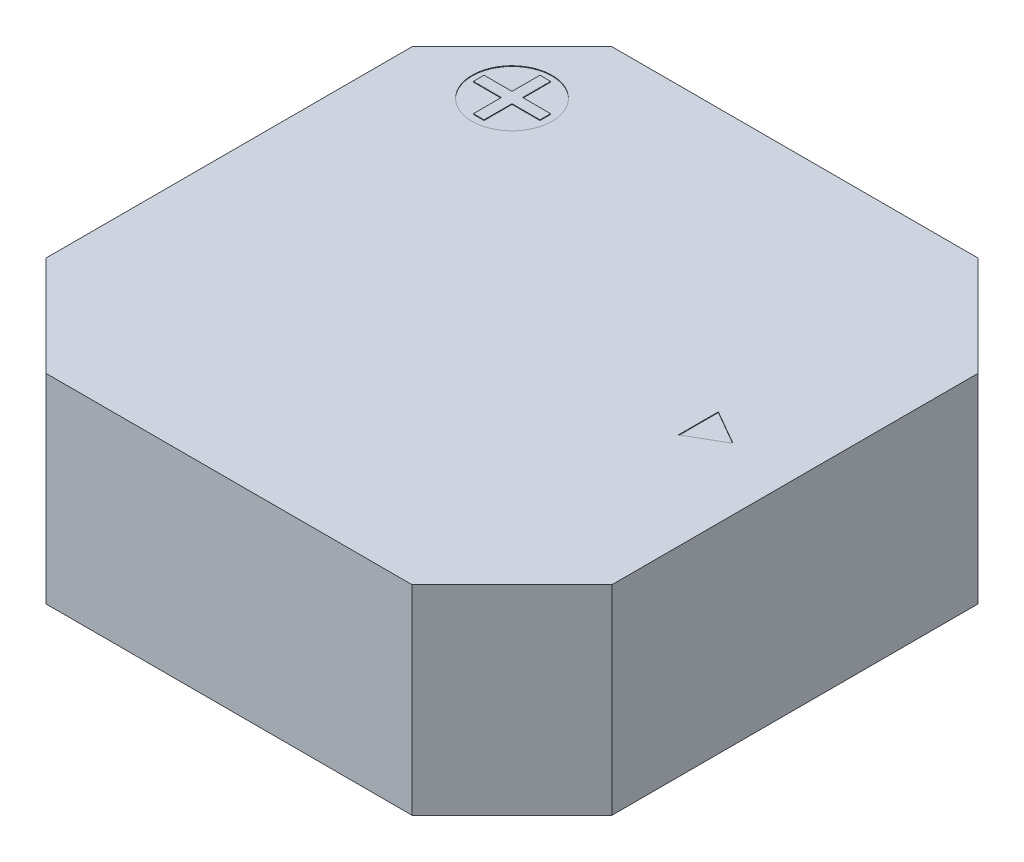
from build123d import *

# Parameters (mm, degrees)
BOSS_EXTRU_1_DEPTH      = 3
ESQUISSE2_R             = 0.6
ENL_V_MAT_EXTRU_1_DEPTH = 0.01
BOSS_EXTRU_2_DEPTH      = 0.01


with BuildPart() as part:
    # Esquisse1 → Boss.-Extru.1 (new body)
    with BuildSketch(Plane(origin=(0, 0, 0), x_dir=(1, 0, 0), z_dir=(0, 1, 0))):
        Polygon((-4.25, 2.75), (-2.75, 4.25), (2.75, 4.25), (4.25, 2.75), (4.25, -2.75), (2.75, -4.25), (-2.75, -4.25), (-4.25, -2.75), align=None)
    extrude(amount=BOSS_EXTRU_1_DEPTH)

    # Esquisse2 → Enl_v. mat.-Extru.1 (cut)
    with BuildSketch(Plane(origin=(0, 3, 0), x_dir=(1, 0, 0), z_dir=(0, 1, 0))):
        with Locations(Location((-2.828427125, 2.828427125, 0), (0, 0, 270))):
            Circle(ESQUISSE2_R)
        Polygon((2.8, 0.3), (2.8, -0.3), (3.319615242, 0), align=None)
    extrude(amount=-ENL_V_MAT_EXTRU_1_DEPTH, mode=Mode.SUBTRACT)


with BuildPart() as body_2:
    # Esquisse3 → Boss.-Extru.2 (new body)
    with BuildSketch(Plane(origin=(0, 3, 0), x_dir=(1, 0, 0), z_dir=(0, 1, 0))):
        Polygon((-2.908427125, 3.328427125), (-2.908427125, 2.908427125), (-3.328427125, 2.908427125), (-3.328427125, 2.748427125), (-2.908427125, 2.748427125), (-2.908427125, 2.328427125), (-2.748427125, 2.328427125), (-2.748427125, 2.748427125), (-2.328427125, 2.748427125), (-2.328427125, 2.908427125), (-2.748427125, 2.908427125), (-2.748427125, 3.328427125), align=None)
    extrude(amount=BOSS_EXTRU_2_DEPTH)


solid = Compound([part.part, body_2.part])
